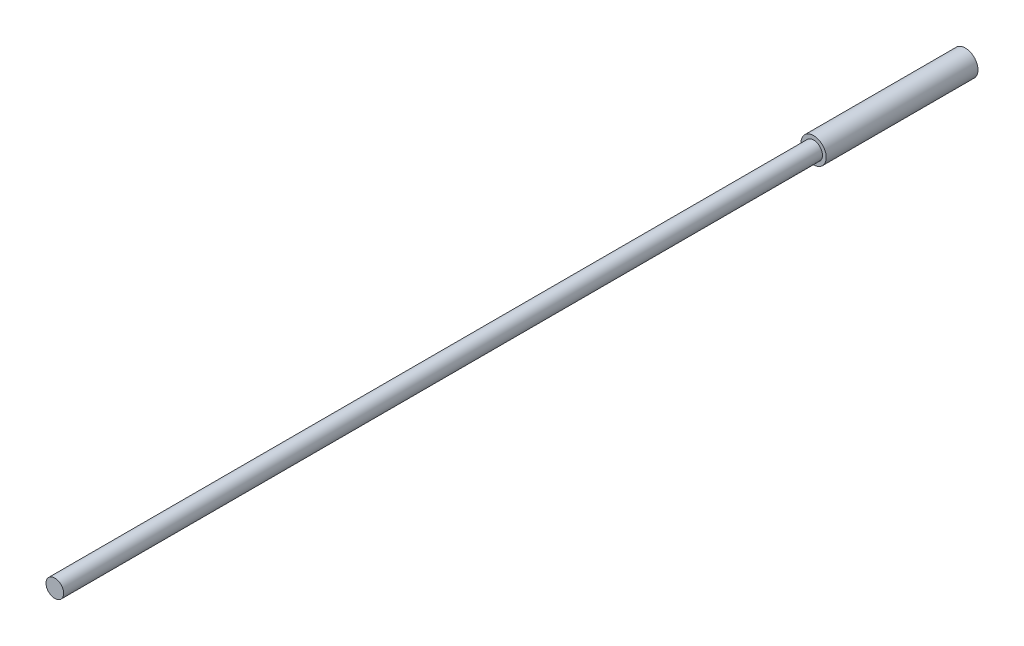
from build123d import *

# Parameters (mm, degrees)
SKETCH_1_R          = 0.5
EXTRUDE_1_DEPTH     = 6
SKETCH_2_R          = 0.35
EXTRUDE_2_DEPTH     = 30
SKETCH_3_R          = 0.1375
SKETCH_3_R_2        = 0.1325
CUT_EXTRUDE_1_DEPTH = 0.1


with BuildPart() as part:
    # Sketch 1 → Extrude 1 (new body)
    with BuildSketch(Plane.XY):
        Circle(SKETCH_1_R)
    extrude(amount=EXTRUDE_1_DEPTH)

    # Sketch 2 → Extrude 2 (add)
    with BuildSketch(Plane.XY.offset(6)):
        Circle(SKETCH_2_R)
    extrude(amount=EXTRUDE_2_DEPTH)

    # Sketch 3 → Cut-Extrude 1 (cut)
    with BuildSketch(Plane(origin=(0, 0, 0), x_dir=(-1, 0, 0), z_dir=(0, 0, -1))):
        Circle(SKETCH_3_R)
        Circle(SKETCH_3_R_2, mode=Mode.SUBTRACT)
    extrude(amount=-CUT_EXTRUDE_1_DEPTH, mode=Mode.SUBTRACT)


solid = part.part
